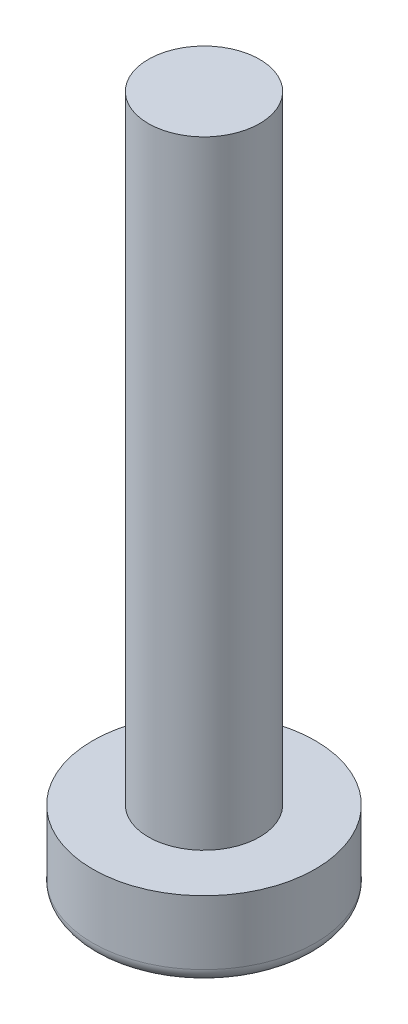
from build123d import *

# Parameters (mm, degrees)
SKETCH_1_R      = 4
EXTRUDE_1_DEPTH = 2.8
EXTRUDE_START   = 2.8
SKETCH_1_3_R    = 2
EXTRUDE_2_DEPTH = 22.2
FILLET_1_R      = 0.5


with BuildPart() as part:
    # Sketch 1 → Extrude 1 (new body)
    with BuildSketch(Plane(origin=(0, 0, 0), x_dir=(1, 0, 0), z_dir=(0, 1, 0))):
        with Locations(Location((0, 0, 0), (0, 0, 270))):
            Circle(SKETCH_1_R)
    extrude(amount=EXTRUDE_1_DEPTH)

    # Sketch 1_3 → Extrude 2 (add)
    with BuildSketch(Plane(origin=(0, 0, 0), x_dir=(1, 0, 0), z_dir=(0, 1, 0)).offset(EXTRUDE_START)):
        with Locations(Location((0, 0, 0), (0, 0, 270))):
            Circle(SKETCH_1_3_R)
    extrude(amount=EXTRUDE_2_DEPTH)

    # Fillet 1
    fillet_1_edges = [part.edges().sort_by_distance(p)[0] for p in [
        (0, 0, -4),
    ]]
    fillet(fillet_1_edges, radius=FILLET_1_R)


solid = part.part
